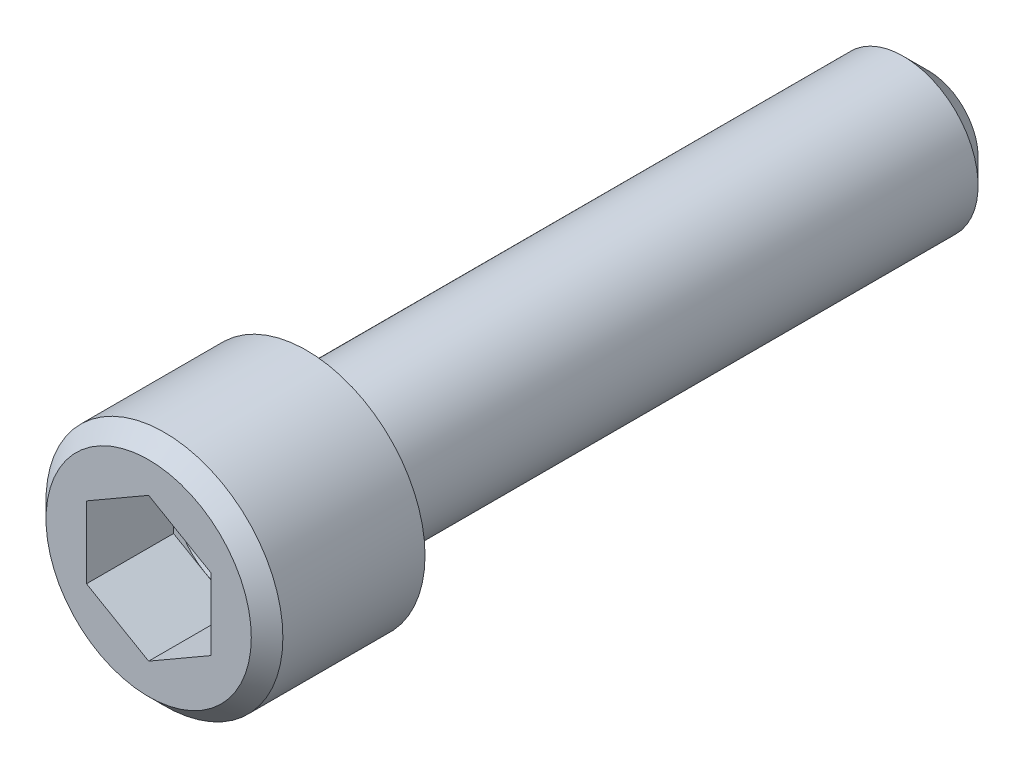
ISO-10303-21;
HEADER;
FILE_DESCRIPTION(('STEP AP214'),'2;1');
FILE_NAME('part.step','',(''),(''),'','','');
FILE_SCHEMA(('AUTOMOTIVE_DESIGN { 1 0 10303 214 1 1 1 1 }'));
ENDSEC;
DATA;
#1=APPLICATION_CONTEXT('core data for automotive mechanical design processes');
#2=APPLICATION_PROTOCOL_DEFINITION('international standard','automotive_design',2000,#1);
#3=PRODUCT_CONTEXT('',#1,'mechanical');
#4=PRODUCT('Part','Part','',(#3));
#5=PRODUCT_RELATED_PRODUCT_CATEGORY('part','',(#4));
#6=PRODUCT_DEFINITION_FORMATION('','',#4);
#7=PRODUCT_DEFINITION_CONTEXT('part definition',#1,'design');
#8=PRODUCT_DEFINITION('design','',#6,#7);
#9=PRODUCT_DEFINITION_SHAPE('','',#8);
#10=(LENGTH_UNIT() NAMED_UNIT(*) SI_UNIT(.MILLI.,.METRE.));
#11=(NAMED_UNIT(*) PLANE_ANGLE_UNIT() SI_UNIT($,.RADIAN.));
#12=(NAMED_UNIT(*) SI_UNIT($,.STERADIAN.) SOLID_ANGLE_UNIT());
#13=UNCERTAINTY_MEASURE_WITH_UNIT(LENGTH_MEASURE(1.E-05),#10,'distance_accuracy_value','');
#14=(GEOMETRIC_REPRESENTATION_CONTEXT(3) GLOBAL_UNCERTAINTY_ASSIGNED_CONTEXT((#13)) GLOBAL_UNIT_ASSIGNED_CONTEXT((#10,
#11,#12)) REPRESENTATION_CONTEXT('',''));
#15=CARTESIAN_POINT('',(0.,0.,0.));
#16=DIRECTION('',(0.,0.,1.));
#17=DIRECTION('',(1.,0.,0.));
#18=AXIS2_PLACEMENT_3D('',#15,#16,#17);
#19=CARTESIAN_POINT('',(-5.,0.,2.85));
#20=DIRECTION('',(0.,0.,-1.));
#21=DIRECTION('',(-1.,0.,0.));
#22=AXIS2_PLACEMENT_3D('',#19,#20,#21);
#23=PLANE('',#22);
#24=DIRECTION('',(0.,-1.,0.));
#25=VECTOR('',#24,1.);
#26=CARTESIAN_POINT('',(-2.5,1.44337567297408,2.85));
#27=LINE('',#26,#25);
#28=CARTESIAN_POINT('',(-2.5,1.44337567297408,2.85));
#29=VERTEX_POINT('',#28);
#30=CARTESIAN_POINT('',(-2.5,0.,2.85));
#31=VERTEX_POINT('',#30);
#32=EDGE_CURVE('E126',#29,#31,#27,.T.);
#33=ORIENTED_EDGE('',*,*,#32,.T.);
#34=CARTESIAN_POINT('',(0.,0.,2.85));
#35=DIRECTION('',(0.,0.,1.));
#36=DIRECTION('',(1.,0.,0.));
#37=AXIS2_PLACEMENT_3D('',#34,#35,#36);
#38=CIRCLE('',#37,2.5);
#39=CARTESIAN_POINT('',(-1.25000000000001,2.16506350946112,2.85));
#40=VERTEX_POINT('',#39);
#41=EDGE_CURVE('E29',#40,#31,#38,.T.);
#42=ORIENTED_EDGE('',*,*,#41,.F.);
#43=DIRECTION('',(-0.866025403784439,-0.5,0.));
#44=VECTOR('',#43,1.);
#45=CARTESIAN_POINT('',(0.,2.88675134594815,2.85));
#46=LINE('',#45,#44);
#47=EDGE_CURVE('E120',#40,#29,#46,.T.);
#48=ORIENTED_EDGE('',*,*,#47,.T.);
#49=EDGE_LOOP('',(#33,#42,#48));
#50=FACE_BOUND('',#49,.T.);
#51=ADVANCED_FACE('F14',(#50),#23,.F.);
#52=CARTESIAN_POINT('',(0.,2.88675134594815,2.85));
#53=VERTEX_POINT('',#52);
#54=EDGE_CURVE('E108',#53,#40,#46,.T.);
#55=ORIENTED_EDGE('',*,*,#54,.T.);
#56=CARTESIAN_POINT('',(1.25000000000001,2.16506350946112,2.85));
#57=VERTEX_POINT('',#56);
#58=EDGE_CURVE('E94',#57,#40,#38,.T.);
#59=ORIENTED_EDGE('',*,*,#58,.F.);
#60=DIRECTION('',(-0.866025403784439,0.5,0.));
#61=VECTOR('',#60,1.);
#62=CARTESIAN_POINT('',(2.5,1.44337567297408,2.85));
#63=LINE('',#62,#61);
#64=EDGE_CURVE('E105',#57,#53,#63,.T.);
#65=ORIENTED_EDGE('',*,*,#64,.T.);
#66=EDGE_LOOP('',(#55,#59,#65));
#67=FACE_BOUND('',#66,.T.);
#68=ADVANCED_FACE('F104',(#67),#23,.F.);
#69=CARTESIAN_POINT('',(2.5,1.44337567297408,2.85));
#70=VERTEX_POINT('',#69);
#71=EDGE_CURVE('E113',#70,#57,#63,.T.);
#72=ORIENTED_EDGE('',*,*,#71,.T.);
#73=CARTESIAN_POINT('',(2.5,0.,2.85));
#74=VERTEX_POINT('',#73);
#75=EDGE_CURVE('E92',#74,#57,#38,.T.);
#76=ORIENTED_EDGE('',*,*,#75,.F.);
#77=DIRECTION('',(0.,1.,0.));
#78=VECTOR('',#77,1.);
#79=CARTESIAN_POINT('',(2.5,-1.44337567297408,2.85));
#80=LINE('',#79,#78);
#81=EDGE_CURVE('E118',#74,#70,#80,.T.);
#82=ORIENTED_EDGE('',*,*,#81,.T.);
#83=EDGE_LOOP('',(#72,#76,#82));
#84=FACE_BOUND('',#83,.T.);
#85=ADVANCED_FACE('F117',(#84),#23,.F.);
#86=CARTESIAN_POINT('',(2.5,-1.44337567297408,2.85));
#87=VERTEX_POINT('',#86);
#88=EDGE_CURVE('E115',#87,#74,#80,.T.);
#89=ORIENTED_EDGE('',*,*,#88,.T.);
#90=CARTESIAN_POINT('',(1.25,-2.16506350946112,2.85));
#91=VERTEX_POINT('',#90);
#92=EDGE_CURVE('E96',#91,#74,#38,.T.);
#93=ORIENTED_EDGE('',*,*,#92,.F.);
#94=DIRECTION('',(0.866025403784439,0.5,0.));
#95=VECTOR('',#94,1.);
#96=CARTESIAN_POINT('',(0.,-2.88675134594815,2.85));
#97=LINE('',#96,#95);
#98=EDGE_CURVE('E368',#91,#87,#97,.T.);
#99=ORIENTED_EDGE('',*,*,#98,.T.);
#100=EDGE_LOOP('',(#89,#93,#99));
#101=FACE_BOUND('',#100,.T.);
#102=ADVANCED_FACE('F274',(#101),#23,.F.);
#103=CARTESIAN_POINT('',(0.,-2.88675134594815,2.85));
#104=VERTEX_POINT('',#103);
#105=EDGE_CURVE('E369',#104,#91,#97,.T.);
#106=ORIENTED_EDGE('',*,*,#105,.T.);
#107=CARTESIAN_POINT('',(-1.25000000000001,-2.16506350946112,2.85));
#108=VERTEX_POINT('',#107);
#109=EDGE_CURVE('E382',#108,#91,#38,.T.);
#110=ORIENTED_EDGE('',*,*,#109,.F.);
#111=DIRECTION('',(0.866025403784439,-0.5,0.));
#112=VECTOR('',#111,1.);
#113=CARTESIAN_POINT('',(-2.5,-1.44337567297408,2.85));
#114=LINE('',#113,#112);
#115=EDGE_CURVE('E365',#108,#104,#114,.T.);
#116=ORIENTED_EDGE('',*,*,#115,.T.);
#117=EDGE_LOOP('',(#106,#110,#116));
#118=FACE_BOUND('',#117,.T.);
#119=ADVANCED_FACE('F170',(#118),#23,.F.);
#120=CARTESIAN_POINT('',(0.,4.7625,0.));
#121=DIRECTION('',(0.,0.,-1.));
#122=DIRECTION('',(-1.,0.,0.));
#123=AXIS2_PLACEMENT_3D('',#120,#121,#122);
#124=PLANE('',#123);
#125=CARTESIAN_POINT('',(0.,0.,0.));
#126=DIRECTION('',(0.,0.,1.));
#127=DIRECTION('',(1.,0.,0.));
#128=AXIS2_PLACEMENT_3D('',#125,#126,#127);
#129=CIRCLE('',#128,4.7625);
#130=CARTESIAN_POINT('',(4.7625,0.,0.));
#131=VERTEX_POINT('',#130);
#132=EDGE_CURVE('E143',#131,#131,#129,.T.);
#133=ORIENTED_EDGE('',*,*,#132,.F.);
#134=EDGE_LOOP('',(#133));
#135=FACE_BOUND('',#134,.T.);
#136=CARTESIAN_POINT('',(0.,0.,0.));
#137=DIRECTION('',(0.,0.,-1.));
#138=DIRECTION('',(-1.,0.,0.));
#139=AXIS2_PLACEMENT_3D('',#136,#137,#138);
#140=CIRCLE('',#139,3.);
#141=CARTESIAN_POINT('',(-3.,0.,0.));
#142=VERTEX_POINT('',#141);
#143=EDGE_CURVE('E132',#142,#142,#140,.T.);
#144=ORIENTED_EDGE('',*,*,#143,.F.);
#145=EDGE_LOOP('',(#144));
#146=FACE_BOUND('',#145,.T.);
#147=ADVANCED_FACE('F287',(#135,#146),#124,.T.);
#148=CARTESIAN_POINT('',(0.,0.,6.35));
#149=DIRECTION('',(0.,0.,1.));
#150=DIRECTION('',(1.,0.,0.));
#151=AXIS2_PLACEMENT_3D('',#148,#149,#150);
#152=PLANE('',#151);
#153=DIRECTION('',(0.866025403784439,-0.5,0.));
#154=VECTOR('',#153,1.);
#155=CARTESIAN_POINT('',(-2.5,-1.44337567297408,6.35));
#156=LINE('',#155,#154);
#157=CARTESIAN_POINT('',(-2.5,-1.44337567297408,6.35));
#158=VERTEX_POINT('',#157);
#159=CARTESIAN_POINT('',(0.,-2.88675134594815,6.35));
#160=VERTEX_POINT('',#159);
#161=EDGE_CURVE('E37',#158,#160,#156,.T.);
#162=ORIENTED_EDGE('',*,*,#161,.F.);
#163=DIRECTION('',(0.,-1.,0.));
#164=VECTOR('',#163,1.);
#165=CARTESIAN_POINT('',(-2.5,1.44337567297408,6.35));
#166=LINE('',#165,#164);
#167=CARTESIAN_POINT('',(-2.5,1.44337567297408,6.35));
#168=VERTEX_POINT('',#167);
#169=EDGE_CURVE('E349',#168,#158,#166,.T.);
#170=ORIENTED_EDGE('',*,*,#169,.F.);
#171=DIRECTION('',(-0.866025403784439,-0.5,0.));
#172=VECTOR('',#171,1.);
#173=CARTESIAN_POINT('',(0.,2.88675134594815,6.35));
#174=LINE('',#173,#172);
#175=CARTESIAN_POINT('',(0.,2.88675134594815,6.35));
#176=VERTEX_POINT('',#175);
#177=EDGE_CURVE('E361',#176,#168,#174,.T.);
#178=ORIENTED_EDGE('',*,*,#177,.F.);
#179=DIRECTION('',(-0.866025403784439,0.5,0.));
#180=VECTOR('',#179,1.);
#181=CARTESIAN_POINT('',(2.5,1.44337567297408,6.35));
#182=LINE('',#181,#180);
#183=CARTESIAN_POINT('',(2.5,1.44337567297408,6.35));
#184=VERTEX_POINT('',#183);
#185=EDGE_CURVE('E359',#184,#176,#182,.T.);
#186=ORIENTED_EDGE('',*,*,#185,.F.);
#187=DIRECTION('',(0.,1.,0.));
#188=VECTOR('',#187,1.);
#189=CARTESIAN_POINT('',(2.5,-1.44337567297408,6.35));
#190=LINE('',#189,#188);
#191=CARTESIAN_POINT('',(2.5,-1.44337567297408,6.35));
#192=VERTEX_POINT('',#191);
#193=EDGE_CURVE('E354',#192,#184,#190,.T.);
#194=ORIENTED_EDGE('',*,*,#193,.F.);
#195=DIRECTION('',(0.866025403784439,0.5,0.));
#196=VECTOR('',#195,1.);
#197=CARTESIAN_POINT('',(0.,-2.88675134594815,6.35));
#198=LINE('',#197,#196);
#199=EDGE_CURVE('E352',#160,#192,#198,.T.);
#200=ORIENTED_EDGE('',*,*,#199,.F.);
#201=EDGE_LOOP('',(#162,#170,#178,#186,#194,#200));
#202=FACE_BOUND('',#201,.T.);
#203=CARTESIAN_POINT('',(0.,0.,6.35));
#204=DIRECTION('',(0.,0.,1.));
#205=DIRECTION('',(1.,0.,0.));
#206=AXIS2_PLACEMENT_3D('',#203,#204,#205);
#207=CIRCLE('',#206,4.1275);
#208=CARTESIAN_POINT('',(4.1275,0.,6.35));
#209=VERTEX_POINT('',#208);
#210=EDGE_CURVE('E149',#209,#209,#207,.T.);
#211=ORIENTED_EDGE('',*,*,#210,.T.);
#212=EDGE_LOOP('',(#211));
#213=FACE_BOUND('',#212,.T.);
#214=ADVANCED_FACE('F16',(#202,#213),#152,.T.);
#215=CARTESIAN_POINT('',(0.,0.,6.35));
#216=DIRECTION('',(0.,0.,-1.));
#217=DIRECTION('',(-1.,0.,0.));
#218=AXIS2_PLACEMENT_3D('',#215,#216,#217);
#219=CONICAL_SURFACE('',#218,4.1275,0.78539816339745);
#220=CARTESIAN_POINT('',(0.,0.,5.715));
#221=DIRECTION('',(0.,0.,1.));
#222=DIRECTION('',(1.,0.,0.));
#223=AXIS2_PLACEMENT_3D('',#220,#221,#222);
#224=CIRCLE('',#223,4.7625);
#225=CARTESIAN_POINT('',(4.7625,0.,5.715));
#226=VERTEX_POINT('',#225);
#227=EDGE_CURVE('E146',#226,#226,#224,.T.);
#228=ORIENTED_EDGE('',*,*,#227,.T.);
#229=EDGE_LOOP('',(#228));
#230=FACE_BOUND('',#229,.T.);
#231=ORIENTED_EDGE('',*,*,#210,.F.);
#232=EDGE_LOOP('',(#231));
#233=FACE_BOUND('',#232,.T.);
#234=ADVANCED_FACE('F303',(#230,#233),#219,.T.);
#235=CARTESIAN_POINT('',(0.,0.,38.1));
#236=DIRECTION('',(0.,0.,1.));
#237=DIRECTION('',(1.,0.,0.));
#238=AXIS2_PLACEMENT_3D('',#235,#236,#237);
#239=CYLINDRICAL_SURFACE('',#238,4.7625);
#240=ORIENTED_EDGE('',*,*,#132,.T.);
#241=EDGE_LOOP('',(#240));
#242=FACE_BOUND('',#241,.T.);
#243=ORIENTED_EDGE('',*,*,#227,.F.);
#244=EDGE_LOOP('',(#243));
#245=FACE_BOUND('',#244,.T.);
#246=ADVANCED_FACE('F311',(#242,#245),#239,.T.);
#247=CARTESIAN_POINT('',(0.,0.,-25.));
#248=DIRECTION('',(0.,0.,1.));
#249=DIRECTION('',(1.,0.,0.));
#250=AXIS2_PLACEMENT_3D('',#247,#248,#249);
#251=CYLINDRICAL_SURFACE('',#250,3.);
#252=CARTESIAN_POINT('',(0.,0.,-24.));
#253=DIRECTION('',(0.,0.,-1.));
#254=DIRECTION('',(-1.,0.,0.));
#255=AXIS2_PLACEMENT_3D('',#252,#253,#254);
#256=CIRCLE('',#255,3.);
#257=CARTESIAN_POINT('',(-3.,0.,-24.));
#258=VERTEX_POINT('',#257);
#259=EDGE_CURVE('E9',#258,#258,#256,.F.);
#260=ORIENTED_EDGE('',*,*,#259,.T.);
#261=EDGE_LOOP('',(#260));
#262=FACE_BOUND('',#261,.T.);
#263=ORIENTED_EDGE('',*,*,#143,.T.);
#264=EDGE_LOOP('',(#263));
#265=FACE_BOUND('',#264,.T.);
#266=ADVANCED_FACE('F171',(#262,#265),#251,.T.);
#267=CARTESIAN_POINT('',(0.,0.,-25.));
#268=DIRECTION('',(0.,0.,-1.));
#269=DIRECTION('',(-1.,0.,0.));
#270=AXIS2_PLACEMENT_3D('',#267,#268,#269);
#271=PLANE('',#270);
#272=CARTESIAN_POINT('',(0.,0.,-25.));
#273=DIRECTION('',(0.,0.,-1.));
#274=DIRECTION('',(-1.,0.,0.));
#275=AXIS2_PLACEMENT_3D('',#272,#273,#274);
#276=CIRCLE('',#275,2.);
#277=CARTESIAN_POINT('',(-2.,0.,-25.));
#278=VERTEX_POINT('',#277);
#279=EDGE_CURVE('E22',#278,#278,#276,.T.);
#280=ORIENTED_EDGE('',*,*,#279,.T.);
#281=EDGE_LOOP('',(#280));
#282=FACE_BOUND('',#281,.T.);
#283=ADVANCED_FACE('F154',(#282),#271,.T.);
#284=CARTESIAN_POINT('',(0.,0.,-25.));
#285=DIRECTION('',(0.,0.,1.));
#286=DIRECTION('',(1.,0.,0.));
#287=AXIS2_PLACEMENT_3D('',#284,#285,#286);
#288=CONICAL_SURFACE('',#287,2.,0.785398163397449);
#289=ORIENTED_EDGE('',*,*,#259,.F.);
#290=EDGE_LOOP('',(#289));
#291=FACE_BOUND('',#290,.T.);
#292=ORIENTED_EDGE('',*,*,#279,.F.);
#293=EDGE_LOOP('',(#292));
#294=FACE_BOUND('',#293,.T.);
#295=ADVANCED_FACE('F156',(#291,#294),#288,.T.);
#296=CARTESIAN_POINT('',(-2.5,-1.44337567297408,2.85));
#297=VERTEX_POINT('',#296);
#298=EDGE_CURVE('E366',#297,#108,#114,.T.);
#299=ORIENTED_EDGE('',*,*,#298,.T.);
#300=EDGE_CURVE('E381',#31,#108,#38,.T.);
#301=ORIENTED_EDGE('',*,*,#300,.F.);
#302=EDGE_CURVE('E125',#31,#297,#27,.T.);
#303=ORIENTED_EDGE('',*,*,#302,.T.);
#304=EDGE_LOOP('',(#299,#301,#303));
#305=FACE_BOUND('',#304,.T.);
#306=ADVANCED_FACE('F158',(#305),#23,.F.);
#307=CARTESIAN_POINT('',(-2.5,-1.44337567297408,2.85));
#308=DIRECTION('',(-0.5,-0.866025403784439,0.));
#309=DIRECTION('',(-0.866025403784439,0.5,0.));
#310=AXIS2_PLACEMENT_3D('',#307,#308,#309);
#311=PLANE('',#310);
#312=ORIENTED_EDGE('',*,*,#161,.T.);
#313=DIRECTION('',(0.,0.,1.));
#314=VECTOR('',#313,1.);
#315=CARTESIAN_POINT('',(0.,-2.88675134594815,2.85));
#316=LINE('',#315,#314);
#317=EDGE_CURVE('E129',#104,#160,#316,.T.);
#318=ORIENTED_EDGE('',*,*,#317,.F.);
#319=ORIENTED_EDGE('',*,*,#115,.F.);
#320=ORIENTED_EDGE('',*,*,#298,.F.);
#321=DIRECTION('',(0.,0.,1.));
#322=VECTOR('',#321,1.);
#323=CARTESIAN_POINT('',(-2.5,-1.44337567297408,2.85));
#324=LINE('',#323,#322);
#325=EDGE_CURVE('E130',#297,#158,#324,.T.);
#326=ORIENTED_EDGE('',*,*,#325,.T.);
#327=EDGE_LOOP('',(#312,#318,#319,#320,#326));
#328=FACE_BOUND('',#327,.T.);
#329=ADVANCED_FACE('F167',(#328),#311,.F.);
#330=CARTESIAN_POINT('',(-2.5,1.44337567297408,2.85));
#331=DIRECTION('',(-1.,0.,0.));
#332=DIRECTION('',(0.,0.,1.));
#333=AXIS2_PLACEMENT_3D('',#330,#331,#332);
#334=PLANE('',#333);
#335=ORIENTED_EDGE('',*,*,#169,.T.);
#336=ORIENTED_EDGE('',*,*,#325,.F.);
#337=ORIENTED_EDGE('',*,*,#302,.F.);
#338=ORIENTED_EDGE('',*,*,#32,.F.);
#339=DIRECTION('',(0.,0.,1.));
#340=VECTOR('',#339,1.);
#341=CARTESIAN_POINT('',(-2.5,1.44337567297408,2.85));
#342=LINE('',#341,#340);
#343=EDGE_CURVE('E133',#29,#168,#342,.T.);
#344=ORIENTED_EDGE('',*,*,#343,.T.);
#345=EDGE_LOOP('',(#335,#336,#337,#338,#344));
#346=FACE_BOUND('',#345,.T.);
#347=ADVANCED_FACE('F182',(#346),#334,.F.);
#348=CARTESIAN_POINT('',(0.,2.88675134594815,2.85));
#349=DIRECTION('',(-0.5,0.866025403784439,0.));
#350=DIRECTION('',(0.866025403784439,0.5,0.));
#351=AXIS2_PLACEMENT_3D('',#348,#349,#350);
#352=PLANE('',#351);
#353=ORIENTED_EDGE('',*,*,#177,.T.);
#354=ORIENTED_EDGE('',*,*,#343,.F.);
#355=ORIENTED_EDGE('',*,*,#47,.F.);
#356=ORIENTED_EDGE('',*,*,#54,.F.);
#357=DIRECTION('',(0.,0.,1.));
#358=VECTOR('',#357,1.);
#359=CARTESIAN_POINT('',(0.,2.88675134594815,2.85));
#360=LINE('',#359,#358);
#361=EDGE_CURVE('E114',#53,#176,#360,.T.);
#362=ORIENTED_EDGE('',*,*,#361,.T.);
#363=EDGE_LOOP('',(#353,#354,#355,#356,#362));
#364=FACE_BOUND('',#363,.T.);
#365=ADVANCED_FACE('F185',(#364),#352,.F.);
#366=CARTESIAN_POINT('',(2.5,1.44337567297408,2.85));
#367=DIRECTION('',(0.5,0.866025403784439,0.));
#368=DIRECTION('',(0.866025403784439,-0.5,0.));
#369=AXIS2_PLACEMENT_3D('',#366,#367,#368);
#370=PLANE('',#369);
#371=ORIENTED_EDGE('',*,*,#185,.T.);
#372=ORIENTED_EDGE('',*,*,#361,.F.);
#373=ORIENTED_EDGE('',*,*,#64,.F.);
#374=ORIENTED_EDGE('',*,*,#71,.F.);
#375=DIRECTION('',(0.,0.,1.));
#376=VECTOR('',#375,1.);
#377=CARTESIAN_POINT('',(2.5,1.44337567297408,2.85));
#378=LINE('',#377,#376);
#379=EDGE_CURVE('E136',#70,#184,#378,.T.);
#380=ORIENTED_EDGE('',*,*,#379,.T.);
#381=EDGE_LOOP('',(#371,#372,#373,#374,#380));
#382=FACE_BOUND('',#381,.T.);
#383=ADVANCED_FACE('F112',(#382),#370,.F.);
#384=CARTESIAN_POINT('',(2.5,-1.44337567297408,2.85));
#385=DIRECTION('',(1.,0.,0.));
#386=DIRECTION('',(0.,0.,-1.));
#387=AXIS2_PLACEMENT_3D('',#384,#385,#386);
#388=PLANE('',#387);
#389=ORIENTED_EDGE('',*,*,#193,.T.);
#390=ORIENTED_EDGE('',*,*,#379,.F.);
#391=ORIENTED_EDGE('',*,*,#81,.F.);
#392=ORIENTED_EDGE('',*,*,#88,.F.);
#393=DIRECTION('',(0.,0.,1.));
#394=VECTOR('',#393,1.);
#395=CARTESIAN_POINT('',(2.5,-1.44337567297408,2.85));
#396=LINE('',#395,#394);
#397=EDGE_CURVE('E138',#87,#192,#396,.T.);
#398=ORIENTED_EDGE('',*,*,#397,.T.);
#399=EDGE_LOOP('',(#389,#390,#391,#392,#398));
#400=FACE_BOUND('',#399,.T.);
#401=ADVANCED_FACE('F192',(#400),#388,.F.);
#402=CARTESIAN_POINT('',(0.,-2.88675134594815,2.85));
#403=DIRECTION('',(0.5,-0.866025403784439,0.));
#404=DIRECTION('',(-0.866025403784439,-0.5,0.));
#405=AXIS2_PLACEMENT_3D('',#402,#403,#404);
#406=PLANE('',#405);
#407=ORIENTED_EDGE('',*,*,#199,.T.);
#408=ORIENTED_EDGE('',*,*,#397,.F.);
#409=ORIENTED_EDGE('',*,*,#98,.F.);
#410=ORIENTED_EDGE('',*,*,#105,.F.);
#411=ORIENTED_EDGE('',*,*,#317,.T.);
#412=EDGE_LOOP('',(#407,#408,#409,#410,#411));
#413=FACE_BOUND('',#412,.T.);
#414=ADVANCED_FACE('F89',(#413),#406,.F.);
#415=CARTESIAN_POINT('',(0.,0.,2.85));
#416=DIRECTION('',(0.,0.,1.));
#417=DIRECTION('',(1.,0.,0.));
#418=AXIS2_PLACEMENT_3D('',#415,#416,#417);
#419=CONICAL_SURFACE('',#418,2.5,1.02461955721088);
#420=CARTESIAN_POINT('',(0.,0.,1.33035721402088));
#421=VERTEX_POINT('',#420);
#422=VERTEX_LOOP('',#421);
#423=FACE_BOUND('',#422,.T.);
#424=ORIENTED_EDGE('',*,*,#75,.T.);
#425=ORIENTED_EDGE('',*,*,#58,.T.);
#426=ORIENTED_EDGE('',*,*,#41,.T.);
#427=ORIENTED_EDGE('',*,*,#300,.T.);
#428=ORIENTED_EDGE('',*,*,#109,.T.);
#429=ORIENTED_EDGE('',*,*,#92,.T.);
#430=EDGE_LOOP('',(#424,#425,#426,#427,#428,#429));
#431=FACE_BOUND('',#430,.T.);
#432=ADVANCED_FACE('F87',(#423,#431),#419,.F.);
#433=CLOSED_SHELL('',(#51,#68,#85,#102,#119,#147,#214,#234,#246,#266,#283,#295,#306,#329,#347,
#365,#383,#401,#414,#432));
#434=MANIFOLD_SOLID_BREP('B1',#433);
#435=ADVANCED_BREP_SHAPE_REPRESENTATION('',(#18,#434),#14);
#436=SHAPE_DEFINITION_REPRESENTATION(#9,#435);
ENDSEC;
END-ISO-10303-21;
